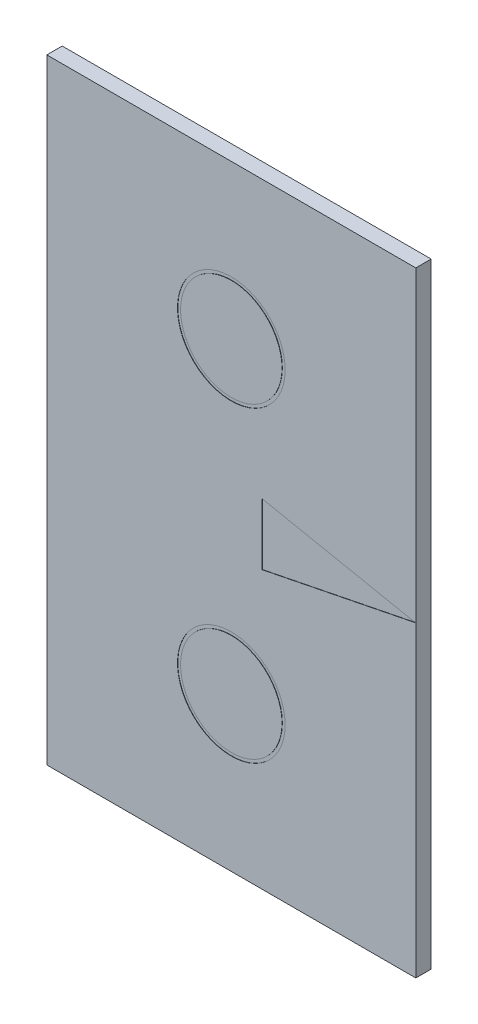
ISO-10303-21;
HEADER;
FILE_DESCRIPTION(('STEP AP214'),'2;1');
FILE_NAME('part.step','',(''),(''),'','','');
FILE_SCHEMA(('AUTOMOTIVE_DESIGN { 1 0 10303 214 1 1 1 1 }'));
ENDSEC;
DATA;
#1=APPLICATION_CONTEXT('core data for automotive mechanical design processes');
#2=APPLICATION_PROTOCOL_DEFINITION('international standard','automotive_design',2000,#1);
#3=PRODUCT_CONTEXT('',#1,'mechanical');
#4=PRODUCT('Part','Part','',(#3));
#5=PRODUCT_RELATED_PRODUCT_CATEGORY('part','',(#4));
#6=PRODUCT_DEFINITION_FORMATION('','',#4);
#7=PRODUCT_DEFINITION_CONTEXT('part definition',#1,'design');
#8=PRODUCT_DEFINITION('design','',#6,#7);
#9=PRODUCT_DEFINITION_SHAPE('','',#8);
#10=(LENGTH_UNIT() NAMED_UNIT(*) SI_UNIT(.MILLI.,.METRE.));
#11=(NAMED_UNIT(*) PLANE_ANGLE_UNIT() SI_UNIT($,.RADIAN.));
#12=(NAMED_UNIT(*) SI_UNIT($,.STERADIAN.) SOLID_ANGLE_UNIT());
#13=UNCERTAINTY_MEASURE_WITH_UNIT(LENGTH_MEASURE(1.E-05),#10,'distance_accuracy_value','');
#14=(GEOMETRIC_REPRESENTATION_CONTEXT(3) GLOBAL_UNCERTAINTY_ASSIGNED_CONTEXT((#13)) GLOBAL_UNIT_ASSIGNED_CONTEXT((#10,
#11,#12)) REPRESENTATION_CONTEXT('',''));
#15=CARTESIAN_POINT('',(0.,0.,0.));
#16=DIRECTION('',(0.,0.,1.));
#17=DIRECTION('',(1.,0.,0.));
#18=AXIS2_PLACEMENT_3D('',#15,#16,#17);
#19=CARTESIAN_POINT('',(0.,10.,0.5));
#20=DIRECTION('',(0.,-1.,0.));
#21=DIRECTION('',(0.,0.,-1.));
#22=AXIS2_PLACEMENT_3D('',#19,#20,#21);
#23=PLANE('',#22);
#24=DIRECTION('',(-1.,0.,0.));
#25=VECTOR('',#24,1.);
#26=CARTESIAN_POINT('',(0.,10.,0.));
#27=LINE('',#26,#25);
#28=CARTESIAN_POINT('',(0.,10.,0.));
#29=VERTEX_POINT('',#28);
#30=CARTESIAN_POINT('',(-12.,10.,0.));
#31=VERTEX_POINT('',#30);
#32=EDGE_CURVE('E113',#29,#31,#27,.T.);
#33=ORIENTED_EDGE('',*,*,#32,.T.);
#34=DIRECTION('',(0.,0.,-1.));
#35=VECTOR('',#34,1.);
#36=CARTESIAN_POINT('',(-12.,10.,0.5));
#37=LINE('',#36,#35);
#38=CARTESIAN_POINT('',(-12.,10.,0.5));
#39=VERTEX_POINT('',#38);
#40=EDGE_CURVE('E9',#39,#31,#37,.T.);
#41=ORIENTED_EDGE('',*,*,#40,.F.);
#42=DIRECTION('',(-1.,0.,0.));
#43=VECTOR('',#42,1.);
#44=CARTESIAN_POINT('',(0.,10.,0.5));
#45=LINE('',#44,#43);
#46=CARTESIAN_POINT('',(0.,10.,0.5));
#47=VERTEX_POINT('',#46);
#48=EDGE_CURVE('E115',#47,#39,#45,.T.);
#49=ORIENTED_EDGE('',*,*,#48,.F.);
#50=DIRECTION('',(0.,0.,-1.));
#51=VECTOR('',#50,1.);
#52=CARTESIAN_POINT('',(0.,10.,0.5));
#53=LINE('',#52,#51);
#54=EDGE_CURVE('E121',#47,#29,#53,.T.);
#55=ORIENTED_EDGE('',*,*,#54,.T.);
#56=EDGE_LOOP('',(#33,#41,#49,#55));
#57=FACE_BOUND('',#56,.T.);
#58=ADVANCED_FACE('F14',(#57),#23,.F.);
#59=CARTESIAN_POINT('',(-12.,10.,0.5));
#60=DIRECTION('',(1.,0.,0.));
#61=DIRECTION('',(0.,0.,1.));
#62=AXIS2_PLACEMENT_3D('',#59,#60,#61);
#63=PLANE('',#62);
#64=DIRECTION('',(0.,-1.,0.));
#65=VECTOR('',#64,1.);
#66=CARTESIAN_POINT('',(-12.,10.,0.));
#67=LINE('',#66,#65);
#68=CARTESIAN_POINT('',(-12.,-10.,0.));
#69=VERTEX_POINT('',#68);
#70=EDGE_CURVE('E124',#31,#69,#67,.T.);
#71=ORIENTED_EDGE('',*,*,#70,.T.);
#72=DIRECTION('',(0.,0.,-1.));
#73=VECTOR('',#72,1.);
#74=CARTESIAN_POINT('',(-12.,-10.,0.5));
#75=LINE('',#74,#73);
#76=CARTESIAN_POINT('',(-12.,-10.,0.5));
#77=VERTEX_POINT('',#76);
#78=EDGE_CURVE('E21',#77,#69,#75,.T.);
#79=ORIENTED_EDGE('',*,*,#78,.F.);
#80=DIRECTION('',(0.,-1.,0.));
#81=VECTOR('',#80,1.);
#82=CARTESIAN_POINT('',(-12.,10.,0.5));
#83=LINE('',#82,#81);
#84=EDGE_CURVE('E65',#39,#77,#83,.T.);
#85=ORIENTED_EDGE('',*,*,#84,.F.);
#86=ORIENTED_EDGE('',*,*,#40,.T.);
#87=EDGE_LOOP('',(#71,#79,#85,#86));
#88=FACE_BOUND('',#87,.T.);
#89=ADVANCED_FACE('F156',(#88),#63,.F.);
#90=CARTESIAN_POINT('',(0.,-10.,0.5));
#91=DIRECTION('',(0.,1.,0.));
#92=DIRECTION('',(0.,0.,1.));
#93=AXIS2_PLACEMENT_3D('',#90,#91,#92);
#94=PLANE('',#93);
#95=DIRECTION('',(1.,0.,0.));
#96=VECTOR('',#95,1.);
#97=CARTESIAN_POINT('',(0.,-10.,0.));
#98=LINE('',#97,#96);
#99=CARTESIAN_POINT('',(0.,-10.,0.));
#100=VERTEX_POINT('',#99);
#101=EDGE_CURVE('E126',#69,#100,#98,.T.);
#102=ORIENTED_EDGE('',*,*,#101,.T.);
#103=DIRECTION('',(0.,0.,-1.));
#104=VECTOR('',#103,1.);
#105=CARTESIAN_POINT('',(0.,-10.,0.5));
#106=LINE('',#105,#104);
#107=CARTESIAN_POINT('',(0.,-10.,0.5));
#108=VERTEX_POINT('',#107);
#109=EDGE_CURVE('E130',#108,#100,#106,.T.);
#110=ORIENTED_EDGE('',*,*,#109,.F.);
#111=DIRECTION('',(1.,0.,0.));
#112=VECTOR('',#111,1.);
#113=CARTESIAN_POINT('',(0.,-10.,0.5));
#114=LINE('',#113,#112);
#115=EDGE_CURVE('E118',#77,#108,#114,.T.);
#116=ORIENTED_EDGE('',*,*,#115,.F.);
#117=ORIENTED_EDGE('',*,*,#78,.T.);
#118=EDGE_LOOP('',(#102,#110,#116,#117));
#119=FACE_BOUND('',#118,.T.);
#120=ADVANCED_FACE('F135',(#119),#94,.F.);
#121=CARTESIAN_POINT('',(0.,10.,0.5));
#122=DIRECTION('',(-1.,0.,0.));
#123=DIRECTION('',(0.,0.,-1.));
#124=AXIS2_PLACEMENT_3D('',#121,#122,#123);
#125=PLANE('',#124);
#126=DIRECTION('',(0.,1.,0.));
#127=VECTOR('',#126,1.);
#128=CARTESIAN_POINT('',(0.,10.,0.));
#129=LINE('',#128,#127);
#130=EDGE_CURVE('E58',#100,#29,#129,.T.);
#131=ORIENTED_EDGE('',*,*,#130,.T.);
#132=ORIENTED_EDGE('',*,*,#54,.F.);
#133=DIRECTION('',(0.,1.,0.));
#134=VECTOR('',#133,1.);
#135=CARTESIAN_POINT('',(0.,10.,0.5));
#136=LINE('',#135,#134);
#137=EDGE_CURVE('E37',#108,#47,#136,.T.);
#138=ORIENTED_EDGE('',*,*,#137,.F.);
#139=ORIENTED_EDGE('',*,*,#109,.T.);
#140=EDGE_LOOP('',(#131,#132,#138,#139));
#141=FACE_BOUND('',#140,.T.);
#142=ADVANCED_FACE('F143',(#141),#125,.F.);
#143=CARTESIAN_POINT('',(0.,0.,0.5));
#144=DIRECTION('',(0.,0.,1.));
#145=DIRECTION('',(0.,-1.,0.));
#146=AXIS2_PLACEMENT_3D('',#143,#144,#145);
#147=PLANE('',#146);
#148=CARTESIAN_POINT('',(-6.,5.,0.5));
#149=DIRECTION('',(0.,0.,1.));
#150=DIRECTION('',(1.,0.,0.));
#151=AXIS2_PLACEMENT_3D('',#148,#149,#150);
#152=CIRCLE('',#151,1.75);
#153=CARTESIAN_POINT('',(-4.25,5.,0.5));
#154=VERTEX_POINT('',#153);
#155=EDGE_CURVE('E337',#154,#154,#152,.T.);
#156=ORIENTED_EDGE('',*,*,#155,.F.);
#157=EDGE_LOOP('',(#156));
#158=FACE_BOUND('',#157,.T.);
#159=CARTESIAN_POINT('',(-6.,-5.,0.5));
#160=DIRECTION('',(0.,0.,1.));
#161=DIRECTION('',(1.,0.,0.));
#162=AXIS2_PLACEMENT_3D('',#159,#160,#161);
#163=CIRCLE('',#162,1.75);
#164=CARTESIAN_POINT('',(-4.25,-5.,0.5));
#165=VERTEX_POINT('',#164);
#166=EDGE_CURVE('E104',#165,#165,#163,.T.);
#167=ORIENTED_EDGE('',*,*,#166,.F.);
#168=EDGE_LOOP('',(#167));
#169=FACE_BOUND('',#168,.T.);
#170=DIRECTION('',(-0.980505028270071,0.1964939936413,0.));
#171=VECTOR('',#170,1.);
#172=CARTESIAN_POINT('',(-0.01,0.,0.5));
#173=LINE('',#172,#171);
#174=CARTESIAN_POINT('',(-0.01,0.,0.5));
#175=VERTEX_POINT('',#174);
#176=CARTESIAN_POINT('',(-5.,1.00000000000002,0.5));
#177=VERTEX_POINT('',#176);
#178=EDGE_CURVE('E28',#175,#177,#173,.T.);
#179=ORIENTED_EDGE('',*,*,#178,.F.);
#180=DIRECTION('',(0.980505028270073,0.196493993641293,0.));
#181=VECTOR('',#180,1.);
#182=CARTESIAN_POINT('',(-0.01,0.,0.5));
#183=LINE('',#182,#181);
#184=CARTESIAN_POINT('',(-5.,-0.999999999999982,0.5));
#185=VERTEX_POINT('',#184);
#186=EDGE_CURVE('E98',#185,#175,#183,.T.);
#187=ORIENTED_EDGE('',*,*,#186,.F.);
#188=DIRECTION('',(0.,-1.,0.));
#189=VECTOR('',#188,1.);
#190=CARTESIAN_POINT('',(-5.,1.00000000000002,0.5));
#191=LINE('',#190,#189);
#192=EDGE_CURVE('E101',#177,#185,#191,.T.);
#193=ORIENTED_EDGE('',*,*,#192,.F.);
#194=EDGE_LOOP('',(#179,#187,#193));
#195=FACE_BOUND('',#194,.T.);
#196=ORIENTED_EDGE('',*,*,#48,.T.);
#197=ORIENTED_EDGE('',*,*,#84,.T.);
#198=ORIENTED_EDGE('',*,*,#115,.T.);
#199=ORIENTED_EDGE('',*,*,#137,.T.);
#200=EDGE_LOOP('',(#196,#197,#198,#199));
#201=FACE_BOUND('',#200,.T.);
#202=ADVANCED_FACE('F145',(#158,#169,#195,#201),#147,.T.);
#203=CARTESIAN_POINT('',(0.,0.,0.));
#204=DIRECTION('',(0.,0.,1.));
#205=DIRECTION('',(0.,-1.,0.));
#206=AXIS2_PLACEMENT_3D('',#203,#204,#205);
#207=PLANE('',#206);
#208=ORIENTED_EDGE('',*,*,#32,.F.);
#209=ORIENTED_EDGE('',*,*,#130,.F.);
#210=ORIENTED_EDGE('',*,*,#101,.F.);
#211=ORIENTED_EDGE('',*,*,#70,.F.);
#212=EDGE_LOOP('',(#208,#209,#210,#211));
#213=FACE_BOUND('',#212,.T.);
#214=ADVANCED_FACE('F139',(#213),#207,.F.);
#215=CARTESIAN_POINT('',(-0.01,0.,0.49));
#216=DIRECTION('',(0.1964939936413,0.980505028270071,0.));
#217=DIRECTION('',(-0.980505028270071,0.1964939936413,0.));
#218=AXIS2_PLACEMENT_3D('',#215,#216,#217);
#219=PLANE('',#218);
#220=ORIENTED_EDGE('',*,*,#178,.T.);
#221=DIRECTION('',(0.,0.,1.));
#222=VECTOR('',#221,1.);
#223=CARTESIAN_POINT('',(-5.,1.00000000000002,0.49));
#224=LINE('',#223,#222);
#225=CARTESIAN_POINT('',(-5.,1.00000000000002,0.49));
#226=VERTEX_POINT('',#225);
#227=EDGE_CURVE('E79',#226,#177,#224,.T.);
#228=ORIENTED_EDGE('',*,*,#227,.F.);
#229=DIRECTION('',(-0.980505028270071,0.1964939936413,0.));
#230=VECTOR('',#229,1.);
#231=CARTESIAN_POINT('',(-0.01,0.,0.49));
#232=LINE('',#231,#230);
#233=CARTESIAN_POINT('',(-0.01,0.,0.49));
#234=VERTEX_POINT('',#233);
#235=EDGE_CURVE('E83',#234,#226,#232,.T.);
#236=ORIENTED_EDGE('',*,*,#235,.F.);
#237=DIRECTION('',(0.,0.,1.));
#238=VECTOR('',#237,1.);
#239=CARTESIAN_POINT('',(-0.01,0.,0.49));
#240=LINE('',#239,#238);
#241=EDGE_CURVE('E111',#234,#175,#240,.T.);
#242=ORIENTED_EDGE('',*,*,#241,.T.);
#243=EDGE_LOOP('',(#220,#228,#236,#242));
#244=FACE_BOUND('',#243,.T.);
#245=ADVANCED_FACE('F81',(#244),#219,.F.);
#246=CARTESIAN_POINT('',(-0.01,0.,0.49));
#247=DIRECTION('',(0.196493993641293,-0.980505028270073,0.));
#248=DIRECTION('',(0.980505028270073,0.196493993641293,0.));
#249=AXIS2_PLACEMENT_3D('',#246,#247,#248);
#250=PLANE('',#249);
#251=ORIENTED_EDGE('',*,*,#186,.T.);
#252=ORIENTED_EDGE('',*,*,#241,.F.);
#253=DIRECTION('',(0.980505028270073,0.196493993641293,0.));
#254=VECTOR('',#253,1.);
#255=CARTESIAN_POINT('',(-0.01,0.,0.49));
#256=LINE('',#255,#254);
#257=CARTESIAN_POINT('',(-5.,-0.999999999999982,0.49));
#258=VERTEX_POINT('',#257);
#259=EDGE_CURVE('E89',#258,#234,#256,.T.);
#260=ORIENTED_EDGE('',*,*,#259,.F.);
#261=DIRECTION('',(0.,0.,1.));
#262=VECTOR('',#261,1.);
#263=CARTESIAN_POINT('',(-5.,-0.999999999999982,0.49));
#264=LINE('',#263,#262);
#265=EDGE_CURVE('E88',#258,#185,#264,.T.);
#266=ORIENTED_EDGE('',*,*,#265,.T.);
#267=EDGE_LOOP('',(#251,#252,#260,#266));
#268=FACE_BOUND('',#267,.T.);
#269=ADVANCED_FACE('F209',(#268),#250,.F.);
#270=CARTESIAN_POINT('',(-5.,1.00000000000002,0.49));
#271=DIRECTION('',(-1.,0.,0.));
#272=DIRECTION('',(0.,0.,-1.));
#273=AXIS2_PLACEMENT_3D('',#270,#271,#272);
#274=PLANE('',#273);
#275=ORIENTED_EDGE('',*,*,#192,.T.);
#276=ORIENTED_EDGE('',*,*,#265,.F.);
#277=DIRECTION('',(0.,-1.,0.));
#278=VECTOR('',#277,1.);
#279=CARTESIAN_POINT('',(-5.,1.00000000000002,0.49));
#280=LINE('',#279,#278);
#281=EDGE_CURVE('E92',#226,#258,#280,.T.);
#282=ORIENTED_EDGE('',*,*,#281,.F.);
#283=ORIENTED_EDGE('',*,*,#227,.T.);
#284=EDGE_LOOP('',(#275,#276,#282,#283));
#285=FACE_BOUND('',#284,.T.);
#286=ADVANCED_FACE('F93',(#285),#274,.F.);
#287=CARTESIAN_POINT('',(0.,0.,0.49));
#288=DIRECTION('',(0.,0.,1.));
#289=DIRECTION('',(0.,-1.,0.));
#290=AXIS2_PLACEMENT_3D('',#287,#288,#289);
#291=PLANE('',#290);
#292=ORIENTED_EDGE('',*,*,#235,.T.);
#293=ORIENTED_EDGE('',*,*,#281,.T.);
#294=ORIENTED_EDGE('',*,*,#259,.T.);
#295=EDGE_LOOP('',(#292,#293,#294));
#296=FACE_BOUND('',#295,.T.);
#297=ADVANCED_FACE('F97',(#296),#291,.T.);
#298=CARTESIAN_POINT('',(-6.,-5.,0.49));
#299=DIRECTION('',(0.,0.,1.));
#300=DIRECTION('',(1.,0.,0.));
#301=AXIS2_PLACEMENT_3D('',#298,#299,#300);
#302=CYLINDRICAL_SURFACE('',#301,1.65);
#303=CARTESIAN_POINT('',(-6.,-5.,0.49));
#304=DIRECTION('',(0.,0.,1.));
#305=DIRECTION('',(1.,0.,0.));
#306=AXIS2_PLACEMENT_3D('',#303,#304,#305);
#307=CIRCLE('',#306,1.65);
#308=CARTESIAN_POINT('',(-4.35,-5.,0.49));
#309=VERTEX_POINT('',#308);
#310=EDGE_CURVE('E346',#309,#309,#307,.T.);
#311=ORIENTED_EDGE('',*,*,#310,.T.);
#312=EDGE_LOOP('',(#311));
#313=FACE_BOUND('',#312,.T.);
#314=CARTESIAN_POINT('',(-6.,-5.,0.5));
#315=DIRECTION('',(0.,0.,1.));
#316=DIRECTION('',(1.,0.,0.));
#317=AXIS2_PLACEMENT_3D('',#314,#315,#316);
#318=CIRCLE('',#317,1.65);
#319=CARTESIAN_POINT('',(-4.35,-5.,0.5));
#320=VERTEX_POINT('',#319);
#321=EDGE_CURVE('E350',#320,#320,#318,.T.);
#322=ORIENTED_EDGE('',*,*,#321,.F.);
#323=EDGE_LOOP('',(#322));
#324=FACE_BOUND('',#323,.T.);
#325=ADVANCED_FACE('F232',(#313,#324),#302,.T.);
#326=CARTESIAN_POINT('',(-6.,-5.,0.49));
#327=DIRECTION('',(0.,0.,1.));
#328=DIRECTION('',(1.,0.,0.));
#329=AXIS2_PLACEMENT_3D('',#326,#327,#328);
#330=CYLINDRICAL_SURFACE('',#329,1.75);
#331=CARTESIAN_POINT('',(-6.,-5.,0.49));
#332=DIRECTION('',(0.,0.,1.));
#333=DIRECTION('',(1.,0.,0.));
#334=AXIS2_PLACEMENT_3D('',#331,#332,#333);
#335=CIRCLE('',#334,1.75);
#336=CARTESIAN_POINT('',(-4.25,-5.,0.49));
#337=VERTEX_POINT('',#336);
#338=EDGE_CURVE('E109',#337,#337,#335,.T.);
#339=ORIENTED_EDGE('',*,*,#338,.F.);
#340=EDGE_LOOP('',(#339));
#341=FACE_BOUND('',#340,.T.);
#342=ORIENTED_EDGE('',*,*,#166,.T.);
#343=EDGE_LOOP('',(#342));
#344=FACE_BOUND('',#343,.T.);
#345=ADVANCED_FACE('F241',(#341,#344),#330,.F.);
#346=CARTESIAN_POINT('',(0.,0.,0.49));
#347=DIRECTION('',(0.,0.,1.));
#348=DIRECTION('',(1.,0.,0.));
#349=AXIS2_PLACEMENT_3D('',#346,#347,#348);
#350=PLANE('',#349);
#351=ORIENTED_EDGE('',*,*,#310,.F.);
#352=EDGE_LOOP('',(#351));
#353=FACE_BOUND('',#352,.T.);
#354=ORIENTED_EDGE('',*,*,#338,.T.);
#355=EDGE_LOOP('',(#354));
#356=FACE_BOUND('',#355,.T.);
#357=ADVANCED_FACE('F251',(#353,#356),#350,.T.);
#358=ORIENTED_EDGE('',*,*,#321,.T.);
#359=EDGE_LOOP('',(#358));
#360=FACE_BOUND('',#359,.T.);
#361=ADVANCED_FACE('F155',(#360),#147,.T.);
#362=CARTESIAN_POINT('',(-6.,5.,0.49));
#363=DIRECTION('',(0.,0.,1.));
#364=DIRECTION('',(1.,0.,0.));
#365=AXIS2_PLACEMENT_3D('',#362,#363,#364);
#366=CYLINDRICAL_SURFACE('',#365,1.65);
#367=CARTESIAN_POINT('',(-6.,5.,0.49));
#368=DIRECTION('',(0.,0.,1.));
#369=DIRECTION('',(1.,0.,0.));
#370=AXIS2_PLACEMENT_3D('',#367,#368,#369);
#371=CIRCLE('',#370,1.65);
#372=CARTESIAN_POINT('',(-4.35,5.,0.49));
#373=VERTEX_POINT('',#372);
#374=EDGE_CURVE('E340',#373,#373,#371,.T.);
#375=ORIENTED_EDGE('',*,*,#374,.T.);
#376=EDGE_LOOP('',(#375));
#377=FACE_BOUND('',#376,.T.);
#378=CARTESIAN_POINT('',(-6.,5.,0.5));
#379=DIRECTION('',(0.,0.,1.));
#380=DIRECTION('',(1.,0.,0.));
#381=AXIS2_PLACEMENT_3D('',#378,#379,#380);
#382=CIRCLE('',#381,1.65);
#383=CARTESIAN_POINT('',(-4.35,5.,0.5));
#384=VERTEX_POINT('',#383);
#385=EDGE_CURVE('E335',#384,#384,#382,.T.);
#386=ORIENTED_EDGE('',*,*,#385,.F.);
#387=EDGE_LOOP('',(#386));
#388=FACE_BOUND('',#387,.T.);
#389=ADVANCED_FACE('F268',(#377,#388),#366,.T.);
#390=CARTESIAN_POINT('',(-6.,5.,0.49));
#391=DIRECTION('',(0.,0.,1.));
#392=DIRECTION('',(1.,0.,0.));
#393=AXIS2_PLACEMENT_3D('',#390,#391,#392);
#394=CYLINDRICAL_SURFACE('',#393,1.75);
#395=CARTESIAN_POINT('',(-6.,5.,0.49));
#396=DIRECTION('',(0.,0.,1.));
#397=DIRECTION('',(1.,0.,0.));
#398=AXIS2_PLACEMENT_3D('',#395,#396,#397);
#399=CIRCLE('',#398,1.75);
#400=CARTESIAN_POINT('',(-4.25,5.,0.49));
#401=VERTEX_POINT('',#400);
#402=EDGE_CURVE('E343',#401,#401,#399,.T.);
#403=ORIENTED_EDGE('',*,*,#402,.F.);
#404=EDGE_LOOP('',(#403));
#405=FACE_BOUND('',#404,.T.);
#406=ORIENTED_EDGE('',*,*,#155,.T.);
#407=EDGE_LOOP('',(#406));
#408=FACE_BOUND('',#407,.T.);
#409=ADVANCED_FACE('F277',(#405,#408),#394,.F.);
#410=CARTESIAN_POINT('',(0.,0.,0.49));
#411=DIRECTION('',(0.,0.,1.));
#412=DIRECTION('',(1.,0.,0.));
#413=AXIS2_PLACEMENT_3D('',#410,#411,#412);
#414=PLANE('',#413);
#415=ORIENTED_EDGE('',*,*,#374,.F.);
#416=EDGE_LOOP('',(#415));
#417=FACE_BOUND('',#416,.T.);
#418=ORIENTED_EDGE('',*,*,#402,.T.);
#419=EDGE_LOOP('',(#418));
#420=FACE_BOUND('',#419,.T.);
#421=ADVANCED_FACE('F286',(#417,#420),#414,.T.);
#422=ORIENTED_EDGE('',*,*,#385,.T.);
#423=EDGE_LOOP('',(#422));
#424=FACE_BOUND('',#423,.T.);
#425=ADVANCED_FACE('F154',(#424),#147,.T.);
#426=CLOSED_SHELL('',(#58,#89,#120,#142,#202,#214,#245,#269,#286,#297,#325,#345,#357,#361,#389,
#409,#421,#425));
#427=MANIFOLD_SOLID_BREP('B1',#426);
#428=ADVANCED_BREP_SHAPE_REPRESENTATION('',(#18,#427),#14);
#429=SHAPE_DEFINITION_REPRESENTATION(#9,#428);
ENDSEC;
END-ISO-10303-21;
